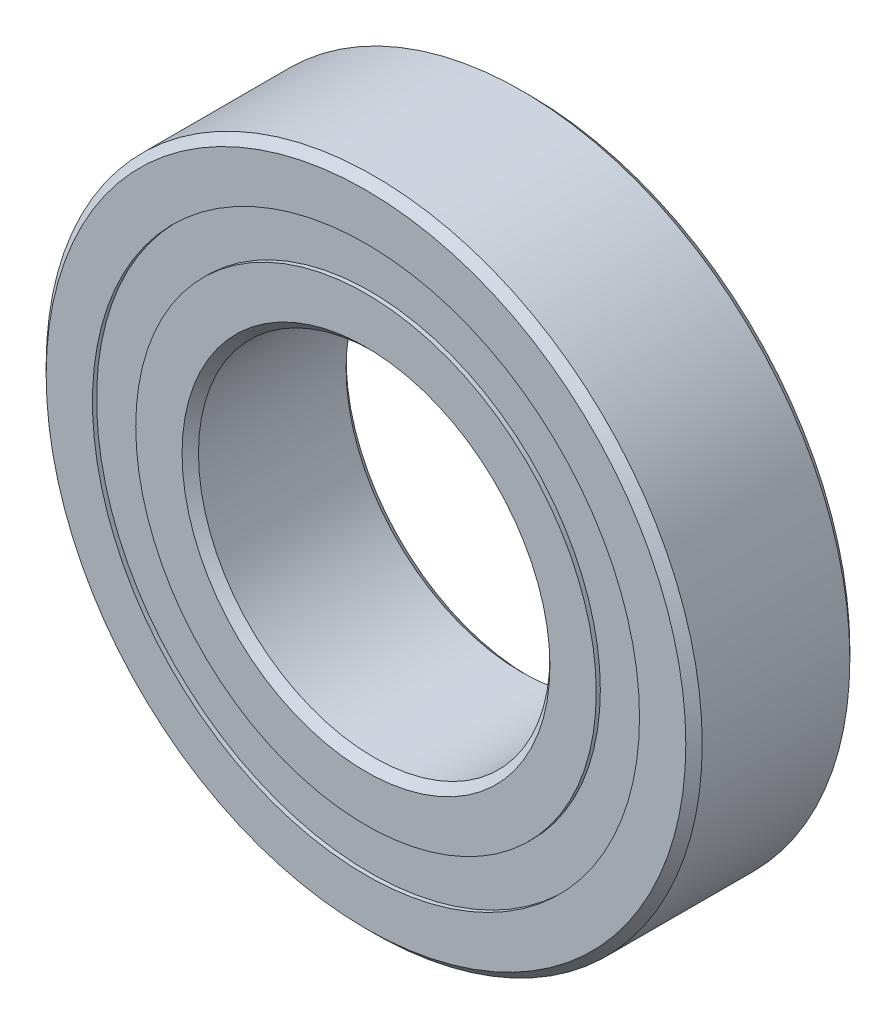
ISO-10303-21;
HEADER;
FILE_DESCRIPTION(('STEP AP214'),'2;1');
FILE_NAME('part.step','',(''),(''),'','','');
FILE_SCHEMA(('AUTOMOTIVE_DESIGN { 1 0 10303 214 1 1 1 1 }'));
ENDSEC;
DATA;
#1=APPLICATION_CONTEXT('core data for automotive mechanical design processes');
#2=APPLICATION_PROTOCOL_DEFINITION('international standard','automotive_design',2000,#1);
#3=PRODUCT_CONTEXT('',#1,'mechanical');
#4=PRODUCT('Part','Part','',(#3));
#5=PRODUCT_RELATED_PRODUCT_CATEGORY('part','',(#4));
#6=PRODUCT_DEFINITION_FORMATION('','',#4);
#7=PRODUCT_DEFINITION_CONTEXT('part definition',#1,'design');
#8=PRODUCT_DEFINITION('design','',#6,#7);
#9=PRODUCT_DEFINITION_SHAPE('','',#8);
#10=(LENGTH_UNIT() NAMED_UNIT(*) SI_UNIT(.MILLI.,.METRE.));
#11=(NAMED_UNIT(*) PLANE_ANGLE_UNIT() SI_UNIT($,.RADIAN.));
#12=(NAMED_UNIT(*) SI_UNIT($,.STERADIAN.) SOLID_ANGLE_UNIT());
#13=UNCERTAINTY_MEASURE_WITH_UNIT(LENGTH_MEASURE(1.E-05),#10,'distance_accuracy_value','');
#14=(GEOMETRIC_REPRESENTATION_CONTEXT(3) GLOBAL_UNCERTAINTY_ASSIGNED_CONTEXT((#13)) GLOBAL_UNIT_ASSIGNED_CONTEXT((#10,
#11,#12)) REPRESENTATION_CONTEXT('',''));
#15=CARTESIAN_POINT('',(0.,0.,0.));
#16=DIRECTION('',(0.,0.,1.));
#17=DIRECTION('',(1.,0.,0.));
#18=AXIS2_PLACEMENT_3D('',#15,#16,#17);
#19=CARTESIAN_POINT('',(0.,0.,3.5));
#20=DIRECTION('',(0.,0.,1.));
#21=DIRECTION('',(1.,0.,0.));
#22=AXIS2_PLACEMENT_3D('',#19,#20,#21);
#23=CYLINDRICAL_SURFACE('',#22,7.50000000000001);
#24=CARTESIAN_POINT('',(0.,0.,-3.15));
#25=DIRECTION('',(0.,0.,-1.));
#26=DIRECTION('',(-1.,0.,0.));
#27=AXIS2_PLACEMENT_3D('',#24,#25,#26);
#28=CIRCLE('',#27,7.50000000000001);
#29=CARTESIAN_POINT('',(-7.50000000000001,0.,-3.15));
#30=VERTEX_POINT('',#29);
#31=EDGE_CURVE('P0_E38',#30,#30,#28,.T.);
#32=ORIENTED_EDGE('',*,*,#31,.T.);
#33=EDGE_LOOP('',(#32));
#34=FACE_BOUND('',#33,.T.);
#35=CARTESIAN_POINT('',(0.,0.,3.15));
#36=DIRECTION('',(0.,0.,1.));
#37=DIRECTION('',(1.,0.,0.));
#38=AXIS2_PLACEMENT_3D('',#35,#36,#37);
#39=CIRCLE('',#38,7.50000000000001);
#40=CARTESIAN_POINT('',(7.50000000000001,0.,3.15));
#41=VERTEX_POINT('',#40);
#42=EDGE_CURVE('P0_E34',#41,#41,#39,.T.);
#43=ORIENTED_EDGE('',*,*,#42,.T.);
#44=EDGE_LOOP('',(#43));
#45=FACE_BOUND('',#44,.T.);
#46=ADVANCED_FACE('P0_F16',(#34,#45),#23,.F.);
#47=CARTESIAN_POINT('',(0.,0.,-3.5));
#48=DIRECTION('',(0.,0.,-1.));
#49=DIRECTION('',(0.,1.,0.));
#50=AXIS2_PLACEMENT_3D('',#47,#48,#49);
#51=CONICAL_SURFACE('',#50,7.85000000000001,0.785398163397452);
#52=CARTESIAN_POINT('',(0.,0.,-3.5));
#53=DIRECTION('',(0.,0.,-1.));
#54=DIRECTION('',(0.,1.,0.));
#55=AXIS2_PLACEMENT_3D('',#52,#53,#54);
#56=CIRCLE('',#55,7.85000000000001);
#57=CARTESIAN_POINT('',(0.,7.85000000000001,-3.5));
#58=VERTEX_POINT('',#57);
#59=EDGE_CURVE('P0_E37',#58,#58,#56,.T.);
#60=ORIENTED_EDGE('',*,*,#59,.T.);
#61=EDGE_LOOP('',(#60));
#62=FACE_BOUND('',#61,.T.);
#63=ORIENTED_EDGE('',*,*,#31,.F.);
#64=EDGE_LOOP('',(#63));
#65=FACE_BOUND('',#64,.T.);
#66=ADVANCED_FACE('P0_F188',(#62,#65),#51,.F.);
#67=CARTESIAN_POINT('',(0.,0.,3.5));
#68=DIRECTION('',(0.,0.,1.));
#69=DIRECTION('',(1.,0.,0.));
#70=AXIS2_PLACEMENT_3D('',#67,#68,#69);
#71=CONICAL_SURFACE('',#70,7.85000000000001,0.785398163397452);
#72=ORIENTED_EDGE('',*,*,#42,.F.);
#73=EDGE_LOOP('',(#72));
#74=FACE_BOUND('',#73,.T.);
#75=CARTESIAN_POINT('',(0.,0.,3.5));
#76=DIRECTION('',(0.,0.,1.));
#77=DIRECTION('',(1.,0.,0.));
#78=AXIS2_PLACEMENT_3D('',#75,#76,#77);
#79=CIRCLE('',#78,7.85000000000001);
#80=CARTESIAN_POINT('',(7.85000000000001,0.,3.5));
#81=VERTEX_POINT('',#80);
#82=EDGE_CURVE('P0_E71',#81,#81,#79,.T.);
#83=ORIENTED_EDGE('',*,*,#82,.T.);
#84=EDGE_LOOP('',(#83));
#85=FACE_BOUND('',#84,.T.);
#86=ADVANCED_FACE('P0_F185',(#74,#85),#71,.F.);
#87=CARTESIAN_POINT('',(0.,7.85000000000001,-3.5));
#88=DIRECTION('',(0.,0.,1.));
#89=DIRECTION('',(1.,0.,0.));
#90=AXIS2_PLACEMENT_3D('',#87,#88,#89);
#91=PLANE('',#90);
#92=ORIENTED_EDGE('',*,*,#59,.F.);
#93=EDGE_LOOP('',(#92));
#94=FACE_BOUND('',#93,.T.);
#95=CARTESIAN_POINT('',(0.,0.,-3.5));
#96=DIRECTION('',(0.,0.,1.));
#97=DIRECTION('',(1.,0.,0.));
#98=AXIS2_PLACEMENT_3D('',#95,#96,#97);
#99=CIRCLE('',#98,9.82692307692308);
#100=CARTESIAN_POINT('',(9.82692307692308,0.,-3.5));
#101=VERTEX_POINT('',#100);
#102=EDGE_CURVE('P0_E68',#101,#101,#99,.T.);
#103=ORIENTED_EDGE('',*,*,#102,.F.);
#104=EDGE_LOOP('',(#103));
#105=FACE_BOUND('',#104,.T.);
#106=ADVANCED_FACE('P0_F181',(#94,#105),#91,.F.);
#107=CARTESIAN_POINT('',(0.,7.85000000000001,3.5));
#108=DIRECTION('',(0.,0.,-1.));
#109=DIRECTION('',(-1.,0.,0.));
#110=AXIS2_PLACEMENT_3D('',#107,#108,#109);
#111=PLANE('',#110);
#112=CARTESIAN_POINT('',(0.,0.,3.5));
#113=DIRECTION('',(0.,0.,1.));
#114=DIRECTION('',(1.,0.,0.));
#115=AXIS2_PLACEMENT_3D('',#112,#113,#114);
#116=CIRCLE('',#115,9.82692307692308);
#117=CARTESIAN_POINT('',(9.82692307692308,0.,3.5));
#118=VERTEX_POINT('',#117);
#119=EDGE_CURVE('P0_E65',#118,#118,#116,.F.);
#120=ORIENTED_EDGE('',*,*,#119,.F.);
#121=EDGE_LOOP('',(#120));
#122=FACE_BOUND('',#121,.T.);
#123=ORIENTED_EDGE('',*,*,#82,.F.);
#124=EDGE_LOOP('',(#123));
#125=FACE_BOUND('',#124,.T.);
#126=ADVANCED_FACE('P0_F177',(#122,#125),#111,.F.);
#127=CARTESIAN_POINT('',(0.,0.,3.5));
#128=DIRECTION('',(0.,0.,1.));
#129=DIRECTION('',(1.,0.,0.));
#130=AXIS2_PLACEMENT_3D('',#127,#128,#129);
#131=CYLINDRICAL_SURFACE('',#130,9.82692307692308);
#132=CARTESIAN_POINT('',(0.,0.,-3.32499999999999));
#133=DIRECTION('',(0.,0.,1.));
#134=DIRECTION('',(1.,0.,0.));
#135=AXIS2_PLACEMENT_3D('',#132,#133,#134);
#136=CIRCLE('',#135,9.82692307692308);
#137=CARTESIAN_POINT('',(9.82692307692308,0.,-3.32499999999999));
#138=VERTEX_POINT('',#137);
#139=EDGE_CURVE('P0_E62',#138,#138,#136,.F.);
#140=ORIENTED_EDGE('',*,*,#139,.T.);
#141=EDGE_LOOP('',(#140));
#142=FACE_BOUND('',#141,.T.);
#143=ORIENTED_EDGE('',*,*,#102,.T.);
#144=EDGE_LOOP('',(#143));
#145=FACE_BOUND('',#144,.T.);
#146=ADVANCED_FACE('P0_F173',(#142,#145),#131,.T.);
#147=CARTESIAN_POINT('',(0.,0.,3.5));
#148=DIRECTION('',(0.,0.,1.));
#149=DIRECTION('',(1.,0.,0.));
#150=AXIS2_PLACEMENT_3D('',#147,#148,#149);
#151=CYLINDRICAL_SURFACE('',#150,9.82692307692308);
#152=ORIENTED_EDGE('',*,*,#119,.T.);
#153=EDGE_LOOP('',(#152));
#154=FACE_BOUND('',#153,.T.);
#155=CARTESIAN_POINT('',(0.,0.,3.32499999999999));
#156=DIRECTION('',(0.,0.,1.));
#157=DIRECTION('',(1.,0.,0.));
#158=AXIS2_PLACEMENT_3D('',#155,#156,#157);
#159=CIRCLE('',#158,9.82692307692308);
#160=CARTESIAN_POINT('',(9.82692307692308,0.,3.32499999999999));
#161=VERTEX_POINT('',#160);
#162=EDGE_CURVE('P0_E59',#161,#161,#159,.T.);
#163=ORIENTED_EDGE('',*,*,#162,.T.);
#164=EDGE_LOOP('',(#163));
#165=FACE_BOUND('',#164,.T.);
#166=ADVANCED_FACE('P0_F169',(#154,#165),#151,.T.);
#167=CARTESIAN_POINT('',(0.,11.6730769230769,-3.32499999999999));
#168=DIRECTION('',(0.,0.,1.));
#169=DIRECTION('',(1.,0.,0.));
#170=AXIS2_PLACEMENT_3D('',#167,#168,#169);
#171=PLANE('',#170);
#172=ORIENTED_EDGE('',*,*,#139,.F.);
#173=EDGE_LOOP('',(#172));
#174=FACE_BOUND('',#173,.T.);
#175=CARTESIAN_POINT('',(0.,0.,-3.32499999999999));
#176=DIRECTION('',(0.,0.,1.));
#177=DIRECTION('',(1.,0.,0.));
#178=AXIS2_PLACEMENT_3D('',#175,#176,#177);
#179=CIRCLE('',#178,11.6730769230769);
#180=CARTESIAN_POINT('',(11.6730769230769,0.,-3.32499999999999));
#181=VERTEX_POINT('',#180);
#182=EDGE_CURVE('P0_E56',#181,#181,#179,.F.);
#183=ORIENTED_EDGE('',*,*,#182,.T.);
#184=EDGE_LOOP('',(#183));
#185=FACE_BOUND('',#184,.T.);
#186=ADVANCED_FACE('P0_F165',(#174,#185),#171,.F.);
#187=CARTESIAN_POINT('',(0.,11.6730769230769,3.32499999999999));
#188=DIRECTION('',(0.,0.,-1.));
#189=DIRECTION('',(-1.,0.,0.));
#190=AXIS2_PLACEMENT_3D('',#187,#188,#189);
#191=PLANE('',#190);
#192=CARTESIAN_POINT('',(0.,0.,3.32499999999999));
#193=DIRECTION('',(0.,0.,1.));
#194=DIRECTION('',(1.,0.,0.));
#195=AXIS2_PLACEMENT_3D('',#192,#193,#194);
#196=CIRCLE('',#195,11.6730769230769);
#197=CARTESIAN_POINT('',(11.6730769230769,0.,3.32499999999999));
#198=VERTEX_POINT('',#197);
#199=EDGE_CURVE('P0_E53',#198,#198,#196,.T.);
#200=ORIENTED_EDGE('',*,*,#199,.T.);
#201=EDGE_LOOP('',(#200));
#202=FACE_BOUND('',#201,.T.);
#203=ORIENTED_EDGE('',*,*,#162,.F.);
#204=EDGE_LOOP('',(#203));
#205=FACE_BOUND('',#204,.T.);
#206=ADVANCED_FACE('P0_F161',(#202,#205),#191,.F.);
#207=CARTESIAN_POINT('',(0.,0.,3.5));
#208=DIRECTION('',(0.,0.,1.));
#209=DIRECTION('',(1.,0.,0.));
#210=AXIS2_PLACEMENT_3D('',#207,#208,#209);
#211=CYLINDRICAL_SURFACE('',#210,11.6730769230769);
#212=CARTESIAN_POINT('',(0.,0.,-3.5));
#213=DIRECTION('',(0.,0.,1.));
#214=DIRECTION('',(1.,0.,0.));
#215=AXIS2_PLACEMENT_3D('',#212,#213,#214);
#216=CIRCLE('',#215,11.6730769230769);
#217=CARTESIAN_POINT('',(11.6730769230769,0.,-3.5));
#218=VERTEX_POINT('',#217);
#219=EDGE_CURVE('P0_E50',#218,#218,#216,.F.);
#220=ORIENTED_EDGE('',*,*,#219,.T.);
#221=EDGE_LOOP('',(#220));
#222=FACE_BOUND('',#221,.T.);
#223=ORIENTED_EDGE('',*,*,#182,.F.);
#224=EDGE_LOOP('',(#223));
#225=FACE_BOUND('',#224,.T.);
#226=ADVANCED_FACE('P0_F157',(#222,#225),#211,.F.);
#227=CARTESIAN_POINT('',(0.,0.,3.5));
#228=DIRECTION('',(0.,0.,1.));
#229=DIRECTION('',(1.,0.,0.));
#230=AXIS2_PLACEMENT_3D('',#227,#228,#229);
#231=CYLINDRICAL_SURFACE('',#230,11.6730769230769);
#232=ORIENTED_EDGE('',*,*,#199,.F.);
#233=EDGE_LOOP('',(#232));
#234=FACE_BOUND('',#233,.T.);
#235=CARTESIAN_POINT('',(0.,0.,3.5));
#236=DIRECTION('',(0.,0.,1.));
#237=DIRECTION('',(1.,0.,0.));
#238=AXIS2_PLACEMENT_3D('',#235,#236,#237);
#239=CIRCLE('',#238,11.6730769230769);
#240=CARTESIAN_POINT('',(11.6730769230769,0.,3.5));
#241=VERTEX_POINT('',#240);
#242=EDGE_CURVE('P0_E47',#241,#241,#239,.T.);
#243=ORIENTED_EDGE('',*,*,#242,.T.);
#244=EDGE_LOOP('',(#243));
#245=FACE_BOUND('',#244,.T.);
#246=ADVANCED_FACE('P0_F153',(#234,#245),#231,.F.);
#247=CARTESIAN_POINT('',(0.,13.65,-3.5));
#248=DIRECTION('',(0.,0.,1.));
#249=DIRECTION('',(1.,0.,0.));
#250=AXIS2_PLACEMENT_3D('',#247,#248,#249);
#251=PLANE('',#250);
#252=ORIENTED_EDGE('',*,*,#219,.F.);
#253=EDGE_LOOP('',(#252));
#254=FACE_BOUND('',#253,.T.);
#255=CARTESIAN_POINT('',(0.,0.,-3.5));
#256=DIRECTION('',(0.,0.,1.));
#257=DIRECTION('',(0.,-1.,0.));
#258=AXIS2_PLACEMENT_3D('',#255,#256,#257);
#259=CIRCLE('',#258,13.65);
#260=CARTESIAN_POINT('',(0.,-13.65,-3.5));
#261=VERTEX_POINT('',#260);
#262=EDGE_CURVE('P0_E44',#261,#261,#259,.T.);
#263=ORIENTED_EDGE('',*,*,#262,.F.);
#264=EDGE_LOOP('',(#263));
#265=FACE_BOUND('',#264,.T.);
#266=ADVANCED_FACE('P0_F149',(#254,#265),#251,.F.);
#267=CARTESIAN_POINT('',(0.,13.65,3.5));
#268=DIRECTION('',(0.,0.,-1.));
#269=DIRECTION('',(-1.,0.,0.));
#270=AXIS2_PLACEMENT_3D('',#267,#268,#269);
#271=PLANE('',#270);
#272=CARTESIAN_POINT('',(0.,0.,3.5));
#273=DIRECTION('',(0.,0.,-1.));
#274=DIRECTION('',(-1.,0.,0.));
#275=AXIS2_PLACEMENT_3D('',#272,#273,#274);
#276=CIRCLE('',#275,13.65);
#277=CARTESIAN_POINT('',(-13.65,0.,3.5));
#278=VERTEX_POINT('',#277);
#279=EDGE_CURVE('P0_E28',#278,#278,#276,.T.);
#280=ORIENTED_EDGE('',*,*,#279,.F.);
#281=EDGE_LOOP('',(#280));
#282=FACE_BOUND('',#281,.T.);
#283=ORIENTED_EDGE('',*,*,#242,.F.);
#284=EDGE_LOOP('',(#283));
#285=FACE_BOUND('',#284,.T.);
#286=ADVANCED_FACE('P0_F145',(#282,#285),#271,.F.);
#287=CARTESIAN_POINT('',(0.,0.,-3.15));
#288=DIRECTION('',(0.,0.,1.));
#289=DIRECTION('',(0.,-1.,0.));
#290=AXIS2_PLACEMENT_3D('',#287,#288,#289);
#291=CONICAL_SURFACE('',#290,14.,0.78539816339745);
#292=CARTESIAN_POINT('',(0.,0.,-3.15));
#293=DIRECTION('',(0.,0.,1.));
#294=DIRECTION('',(1.,0.,0.));
#295=AXIS2_PLACEMENT_3D('',#292,#293,#294);
#296=CIRCLE('',#295,14.);
#297=CARTESIAN_POINT('',(14.,0.,-3.15));
#298=VERTEX_POINT('',#297);
#299=EDGE_CURVE('P0_E23',#298,#298,#296,.T.);
#300=ORIENTED_EDGE('',*,*,#299,.F.);
#301=EDGE_LOOP('',(#300));
#302=FACE_BOUND('',#301,.T.);
#303=ORIENTED_EDGE('',*,*,#262,.T.);
#304=EDGE_LOOP('',(#303));
#305=FACE_BOUND('',#304,.T.);
#306=ADVANCED_FACE('P0_F141',(#302,#305),#291,.T.);
#307=CARTESIAN_POINT('',(0.,0.,3.15));
#308=DIRECTION('',(0.,0.,-1.));
#309=DIRECTION('',(-1.,0.,0.));
#310=AXIS2_PLACEMENT_3D('',#307,#308,#309);
#311=CONICAL_SURFACE('',#310,14.,0.785398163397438);
#312=CARTESIAN_POINT('',(0.,0.,3.15));
#313=DIRECTION('',(0.,0.,1.));
#314=DIRECTION('',(1.,0.,0.));
#315=AXIS2_PLACEMENT_3D('',#312,#313,#314);
#316=CIRCLE('',#315,14.);
#317=CARTESIAN_POINT('',(14.,0.,3.15));
#318=VERTEX_POINT('',#317);
#319=EDGE_CURVE('P0_E10',#318,#318,#316,.F.);
#320=ORIENTED_EDGE('',*,*,#319,.F.);
#321=EDGE_LOOP('',(#320));
#322=FACE_BOUND('',#321,.T.);
#323=ORIENTED_EDGE('',*,*,#279,.T.);
#324=EDGE_LOOP('',(#323));
#325=FACE_BOUND('',#324,.T.);
#326=ADVANCED_FACE('P0_F138',(#322,#325),#311,.T.);
#327=CARTESIAN_POINT('',(0.,0.,3.5));
#328=DIRECTION('',(0.,0.,1.));
#329=DIRECTION('',(1.,0.,0.));
#330=AXIS2_PLACEMENT_3D('',#327,#328,#329);
#331=CYLINDRICAL_SURFACE('',#330,14.);
#332=ORIENTED_EDGE('',*,*,#319,.T.);
#333=EDGE_LOOP('',(#332));
#334=FACE_BOUND('',#333,.T.);
#335=ORIENTED_EDGE('',*,*,#299,.T.);
#336=EDGE_LOOP('',(#335));
#337=FACE_BOUND('',#336,.T.);
#338=ADVANCED_FACE('P0_F135',(#334,#337),#331,.T.);
#339=CLOSED_SHELL('',(#46,#66,#86,#106,#126,#146,#166,#186,#206,#226,#246,#266,#286,#306,#326,#338));
#340=CARTESIAN_POINT('',(0.,0.,0.));
#341=DIRECTION('',(0.,0.,1.));
#342=DIRECTION('',(1.,0.,0.));
#343=AXIS2_PLACEMENT_3D('',#340,#341,#342);
#344=TOROIDAL_SURFACE('',#343,10.75,1.80881842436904);
#345=CARTESIAN_POINT('',(0.,0.,1.55555555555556));
#346=DIRECTION('',(0.,0.,1.));
#347=DIRECTION('',(1.,0.,0.));
#348=AXIS2_PLACEMENT_3D('',#345,#346,#347);
#349=CIRCLE('',#348,9.82692307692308);
#350=CARTESIAN_POINT('',(9.82692307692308,0.,1.55555555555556));
#351=VERTEX_POINT('',#350);
#352=EDGE_CURVE('P0_E91',#351,#351,#349,.T.);
#353=ORIENTED_EDGE('',*,*,#352,.F.);
#354=EDGE_LOOP('',(#353));
#355=FACE_BOUND('',#354,.T.);
#356=CARTESIAN_POINT('',(0.,0.,-1.55555555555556));
#357=DIRECTION('',(0.,0.,1.));
#358=DIRECTION('',(1.,0.,0.));
#359=AXIS2_PLACEMENT_3D('',#356,#357,#358);
#360=CIRCLE('',#359,9.82692307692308);
#361=CARTESIAN_POINT('',(9.82692307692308,0.,-1.55555555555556));
#362=VERTEX_POINT('',#361);
#363=EDGE_CURVE('P0_E87',#362,#362,#360,.F.);
#364=ORIENTED_EDGE('',*,*,#363,.F.);
#365=EDGE_LOOP('',(#364));
#366=FACE_BOUND('',#365,.T.);
#367=ADVANCED_FACE('P0_F130',(#355,#366),#344,.F.);
#368=CARTESIAN_POINT('',(0.,0.,3.5));
#369=DIRECTION('',(0.,0.,1.));
#370=DIRECTION('',(1.,0.,0.));
#371=AXIS2_PLACEMENT_3D('',#368,#369,#370);
#372=CYLINDRICAL_SURFACE('',#371,9.82692307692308);
#373=ORIENTED_EDGE('',*,*,#352,.T.);
#374=EDGE_LOOP('',(#373));
#375=FACE_BOUND('',#374,.T.);
#376=CARTESIAN_POINT('',(0.,0.,1.80881842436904));
#377=DIRECTION('',(0.,0.,1.));
#378=DIRECTION('',(1.,0.,0.));
#379=AXIS2_PLACEMENT_3D('',#376,#377,#378);
#380=CIRCLE('',#379,9.82692307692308);
#381=CARTESIAN_POINT('',(9.82692307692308,0.,1.80881842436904));
#382=VERTEX_POINT('',#381);
#383=EDGE_CURVE('P0_E19',#382,#382,#380,.F.);
#384=ORIENTED_EDGE('',*,*,#383,.T.);
#385=EDGE_LOOP('',(#384));
#386=FACE_BOUND('',#385,.T.);
#387=ADVANCED_FACE('P0_F127',(#375,#386),#372,.T.);
#388=CARTESIAN_POINT('',(0.,0.,3.5));
#389=DIRECTION('',(0.,0.,1.));
#390=DIRECTION('',(1.,0.,0.));
#391=AXIS2_PLACEMENT_3D('',#388,#389,#390);
#392=CYLINDRICAL_SURFACE('',#391,9.82692307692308);
#393=CARTESIAN_POINT('',(0.,0.,-1.80881842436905));
#394=DIRECTION('',(0.,0.,1.));
#395=DIRECTION('',(1.,0.,0.));
#396=AXIS2_PLACEMENT_3D('',#393,#394,#395);
#397=CIRCLE('',#396,9.82692307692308);
#398=CARTESIAN_POINT('',(9.82692307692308,0.,-1.80881842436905));
#399=VERTEX_POINT('',#398);
#400=EDGE_CURVE('P0_E82',#399,#399,#397,.T.);
#401=ORIENTED_EDGE('',*,*,#400,.T.);
#402=EDGE_LOOP('',(#401));
#403=FACE_BOUND('',#402,.T.);
#404=ORIENTED_EDGE('',*,*,#363,.T.);
#405=EDGE_LOOP('',(#404));
#406=FACE_BOUND('',#405,.T.);
#407=ADVANCED_FACE('P0_F123',(#403,#406),#392,.T.);
#408=CARTESIAN_POINT('',(0.,11.6730769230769,1.80881842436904));
#409=DIRECTION('',(0.,0.,1.));
#410=DIRECTION('',(1.,0.,0.));
#411=AXIS2_PLACEMENT_3D('',#408,#409,#410);
#412=PLANE('',#411);
#413=ORIENTED_EDGE('',*,*,#383,.F.);
#414=EDGE_LOOP('',(#413));
#415=FACE_BOUND('',#414,.T.);
#416=CARTESIAN_POINT('',(0.,0.,1.80881842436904));
#417=DIRECTION('',(0.,0.,1.));
#418=DIRECTION('',(1.,0.,0.));
#419=AXIS2_PLACEMENT_3D('',#416,#417,#418);
#420=CIRCLE('',#419,11.6730769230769);
#421=CARTESIAN_POINT('',(11.6730769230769,0.,1.80881842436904));
#422=VERTEX_POINT('',#421);
#423=EDGE_CURVE('P0_E76',#422,#422,#420,.F.);
#424=ORIENTED_EDGE('',*,*,#423,.T.);
#425=EDGE_LOOP('',(#424));
#426=FACE_BOUND('',#425,.T.);
#427=ADVANCED_FACE('P0_F119',(#415,#426),#412,.F.);
#428=CARTESIAN_POINT('',(0.,11.6730769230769,-1.80881842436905));
#429=DIRECTION('',(0.,0.,-1.));
#430=DIRECTION('',(-1.,0.,0.));
#431=AXIS2_PLACEMENT_3D('',#428,#429,#430);
#432=PLANE('',#431);
#433=CARTESIAN_POINT('',(0.,0.,-1.80881842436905));
#434=DIRECTION('',(0.,0.,1.));
#435=DIRECTION('',(1.,0.,0.));
#436=AXIS2_PLACEMENT_3D('',#433,#434,#435);
#437=CIRCLE('',#436,11.6730769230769);
#438=CARTESIAN_POINT('',(11.6730769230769,0.,-1.80881842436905));
#439=VERTEX_POINT('',#438);
#440=EDGE_CURVE('P0_E80',#439,#439,#437,.T.);
#441=ORIENTED_EDGE('',*,*,#440,.T.);
#442=EDGE_LOOP('',(#441));
#443=FACE_BOUND('',#442,.T.);
#444=ORIENTED_EDGE('',*,*,#400,.F.);
#445=EDGE_LOOP('',(#444));
#446=FACE_BOUND('',#445,.T.);
#447=ADVANCED_FACE('P0_F115',(#443,#446),#432,.F.);
#448=CARTESIAN_POINT('',(0.,0.,3.5));
#449=DIRECTION('',(0.,0.,1.));
#450=DIRECTION('',(1.,0.,0.));
#451=AXIS2_PLACEMENT_3D('',#448,#449,#450);
#452=CYLINDRICAL_SURFACE('',#451,11.6730769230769);
#453=CARTESIAN_POINT('',(0.,0.,1.55555555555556));
#454=DIRECTION('',(0.,0.,1.));
#455=DIRECTION('',(1.,0.,0.));
#456=AXIS2_PLACEMENT_3D('',#453,#454,#455);
#457=CIRCLE('',#456,11.6730769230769);
#458=CARTESIAN_POINT('',(11.6730769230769,0.,1.55555555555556));
#459=VERTEX_POINT('',#458);
#460=EDGE_CURVE('P0_E79',#459,#459,#457,.F.);
#461=ORIENTED_EDGE('',*,*,#460,.T.);
#462=EDGE_LOOP('',(#461));
#463=FACE_BOUND('',#462,.T.);
#464=ORIENTED_EDGE('',*,*,#423,.F.);
#465=EDGE_LOOP('',(#464));
#466=FACE_BOUND('',#465,.T.);
#467=ADVANCED_FACE('P0_F111',(#463,#466),#452,.F.);
#468=CARTESIAN_POINT('',(0.,0.,3.5));
#469=DIRECTION('',(0.,0.,1.));
#470=DIRECTION('',(1.,0.,0.));
#471=AXIS2_PLACEMENT_3D('',#468,#469,#470);
#472=CYLINDRICAL_SURFACE('',#471,11.6730769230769);
#473=ORIENTED_EDGE('',*,*,#440,.F.);
#474=EDGE_LOOP('',(#473));
#475=FACE_BOUND('',#474,.T.);
#476=CARTESIAN_POINT('',(0.,0.,-1.55555555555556));
#477=DIRECTION('',(0.,0.,1.));
#478=DIRECTION('',(1.,0.,0.));
#479=AXIS2_PLACEMENT_3D('',#476,#477,#478);
#480=CIRCLE('',#479,11.6730769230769);
#481=CARTESIAN_POINT('',(11.6730769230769,0.,-1.55555555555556));
#482=VERTEX_POINT('',#481);
#483=EDGE_CURVE('P0_E41',#482,#482,#480,.T.);
#484=ORIENTED_EDGE('',*,*,#483,.T.);
#485=EDGE_LOOP('',(#484));
#486=FACE_BOUND('',#485,.T.);
#487=ADVANCED_FACE('P0_F106',(#475,#486),#472,.F.);
#488=CARTESIAN_POINT('',(0.,0.,0.));
#489=DIRECTION('',(0.,0.,1.));
#490=DIRECTION('',(1.,0.,0.));
#491=AXIS2_PLACEMENT_3D('',#488,#489,#490);
#492=TOROIDAL_SURFACE('',#491,10.75,1.80881842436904);
#493=ORIENTED_EDGE('',*,*,#483,.F.);
#494=EDGE_LOOP('',(#493));
#495=FACE_BOUND('',#494,.T.);
#496=ORIENTED_EDGE('',*,*,#460,.F.);
#497=EDGE_LOOP('',(#496));
#498=FACE_BOUND('',#497,.T.);
#499=ADVANCED_FACE('P0_F103',(#495,#498),#492,.F.);
#500=CLOSED_SHELL('',(#367,#387,#407,#427,#447,#467,#487,#499));
#501=ORIENTED_CLOSED_SHELL('',*,#500,.T.);
#502=BREP_WITH_VOIDS('P0_B1',#339,(#501));
#503=CARTESIAN_POINT('',(0.,-10.75,0.));
#504=DIRECTION('',(0.,-1.,0.));
#505=DIRECTION('',(0.,0.,-1.));
#506=AXIS2_PLACEMENT_3D('',#503,#504,#505);
#507=SPHERICAL_SURFACE('',#506,1.80881842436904);
#508=CARTESIAN_POINT('',(0.,-12.558818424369,0.));
#509=VERTEX_POINT('',#508);
#510=VERTEX_LOOP('',#509);
#511=FACE_BOUND('',#510,.T.);
#512=CARTESIAN_POINT('',(0.,-8.94118157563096,0.));
#513=VERTEX_POINT('',#512);
#514=VERTEX_LOOP('',#513);
#515=FACE_BOUND('',#514,.T.);
#516=ADVANCED_FACE('P1_F15',(#511,#515),#507,.T.);
#517=CLOSED_SHELL('',(#516));
#518=MANIFOLD_SOLID_BREP('P1_B1',#517);
#519=CARTESIAN_POINT('',(0.,10.75,0.));
#520=DIRECTION('',(0.,1.,0.));
#521=DIRECTION('',(0.,0.,-1.));
#522=AXIS2_PLACEMENT_3D('',#519,#520,#521);
#523=SPHERICAL_SURFACE('',#522,1.80881842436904);
#524=CARTESIAN_POINT('',(0.,8.94118157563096,0.));
#525=VERTEX_POINT('',#524);
#526=VERTEX_LOOP('',#525);
#527=FACE_BOUND('',#526,.T.);
#528=CARTESIAN_POINT('',(0.,12.558818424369,0.));
#529=VERTEX_POINT('',#528);
#530=VERTEX_LOOP('',#529);
#531=FACE_BOUND('',#530,.T.);
#532=ADVANCED_FACE('P2_F16',(#527,#531),#523,.T.);
#533=CLOSED_SHELL('',(#532));
#534=MANIFOLD_SOLID_BREP('P2_B1',#533);
#535=ADVANCED_BREP_SHAPE_REPRESENTATION('',(#18,#502,#518,#534),#14);
#536=SHAPE_DEFINITION_REPRESENTATION(#9,#535);
ENDSEC;
END-ISO-10303-21;
